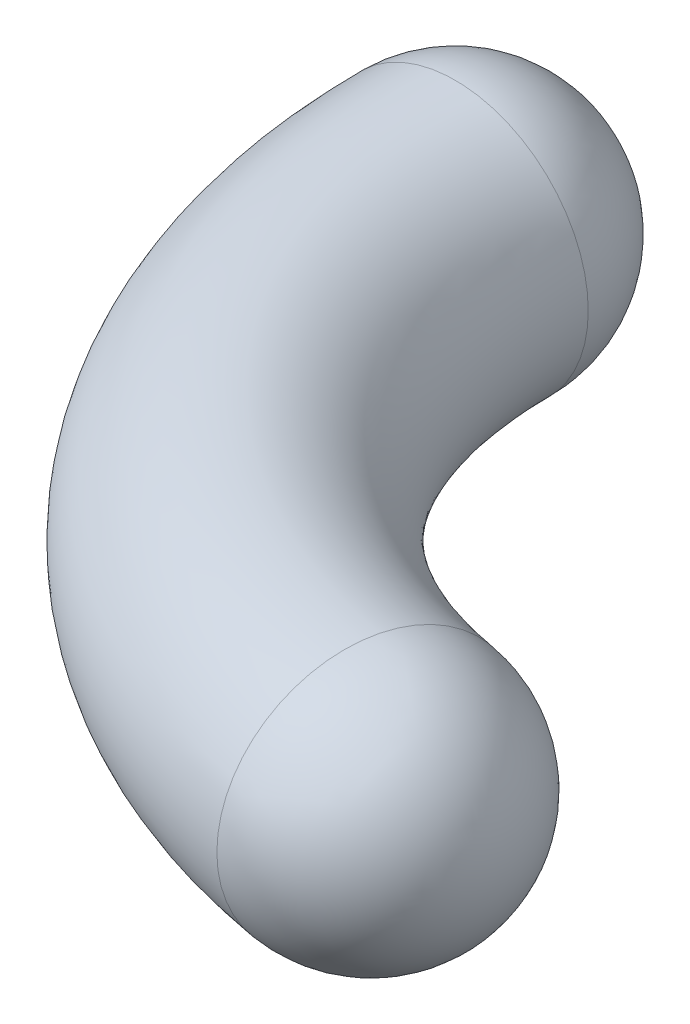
ISO-10303-21;
HEADER;
FILE_DESCRIPTION(('STEP AP214'),'2;1');
FILE_NAME('part.step','',(''),(''),'','','');
FILE_SCHEMA(('AUTOMOTIVE_DESIGN { 1 0 10303 214 1 1 1 1 }'));
ENDSEC;
DATA;
#1=APPLICATION_CONTEXT('core data for automotive mechanical design processes');
#2=APPLICATION_PROTOCOL_DEFINITION('international standard','automotive_design',2000,#1);
#3=PRODUCT_CONTEXT('',#1,'mechanical');
#4=PRODUCT('Part','Part','',(#3));
#5=PRODUCT_RELATED_PRODUCT_CATEGORY('part','',(#4));
#6=PRODUCT_DEFINITION_FORMATION('','',#4);
#7=PRODUCT_DEFINITION_CONTEXT('part definition',#1,'design');
#8=PRODUCT_DEFINITION('design','',#6,#7);
#9=PRODUCT_DEFINITION_SHAPE('','',#8);
#10=(LENGTH_UNIT() NAMED_UNIT(*) SI_UNIT(.MILLI.,.METRE.));
#11=(NAMED_UNIT(*) PLANE_ANGLE_UNIT() SI_UNIT($,.RADIAN.));
#12=(NAMED_UNIT(*) SI_UNIT($,.STERADIAN.) SOLID_ANGLE_UNIT());
#13=UNCERTAINTY_MEASURE_WITH_UNIT(LENGTH_MEASURE(1.E-05),#10,'distance_accuracy_value','');
#14=(GEOMETRIC_REPRESENTATION_CONTEXT(3) GLOBAL_UNCERTAINTY_ASSIGNED_CONTEXT((#13)) GLOBAL_UNIT_ASSIGNED_CONTEXT((#10,
#11,#12)) REPRESENTATION_CONTEXT('',''));
#15=CARTESIAN_POINT('',(0.,0.,0.));
#16=DIRECTION('',(0.,0.,1.));
#17=DIRECTION('',(1.,0.,0.));
#18=AXIS2_PLACEMENT_3D('',#15,#16,#17);
#19=CARTESIAN_POINT('',(0.,0.,0.));
#20=DIRECTION('',(0.,-1.,0.));
#21=DIRECTION('',(0.,0.,-1.));
#22=AXIS2_PLACEMENT_3D('',#19,#20,#21);
#23=TOROIDAL_SURFACE('',#22,40.,10.);
#24=CARTESIAN_POINT('',(-6.94592710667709,0.,39.3923101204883));
#25=DIRECTION('',(0.984807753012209,0.,0.173648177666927));
#26=DIRECTION('',(0.173648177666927,0.,-0.984807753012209));
#27=AXIS2_PLACEMENT_3D('',#24,#25,#26);
#28=CIRCLE('',#27,10.);
#29=CARTESIAN_POINT('',(-8.68240888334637,0.,49.2403876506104));
#30=VERTEX_POINT('',#29);
#31=EDGE_CURVE('E10',#30,#30,#28,.T.);
#32=CARTESIAN_POINT('',(-40.,0.,0.));
#33=DIRECTION('',(0.,0.,1.));
#34=DIRECTION('',(1.,0.,0.));
#35=AXIS2_PLACEMENT_3D('',#32,#33,#34);
#36=CIRCLE('',#35,10.);
#37=CARTESIAN_POINT('',(-50.,0.,0.));
#38=VERTEX_POINT('',#37);
#39=EDGE_CURVE('E43',#38,#38,#36,.T.);
#40=CARTESIAN_POINT('',(0.,0.,0.));
#41=DIRECTION('',(0.,-1.,0.));
#42=DIRECTION('',(0.,0.,-1.));
#43=AXIS2_PLACEMENT_3D('',#40,#41,#42);
#44=CIRCLE('',#43,50.);
#45=EDGE_CURVE('',#30,#38,#44,.T.);
#46=ORIENTED_EDGE('',*,*,#31,.F.);
#47=ORIENTED_EDGE('',*,*,#39,.T.);
#48=ORIENTED_EDGE('',*,*,#45,.T.);
#49=ORIENTED_EDGE('',*,*,#45,.F.);
#50=EDGE_LOOP('',(#46,#48,#47,#49));
#51=FACE_BOUND('',#50,.T.);
#52=ADVANCED_FACE('F36',(#51),#23,.T.);
#53=CARTESIAN_POINT('',(-6.94592710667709,0.,39.3923101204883));
#54=DIRECTION('',(0.,0.,1.));
#55=DIRECTION('',(1.,0.,0.));
#56=AXIS2_PLACEMENT_3D('',#53,#54,#55);
#57=SPHERICAL_SURFACE('',#56,10.);
#58=CARTESIAN_POINT('',(-6.94592710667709,0.,39.3923101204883));
#59=DIRECTION('',(0.984807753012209,0.,0.173648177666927));
#60=DIRECTION('',(0.173648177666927,0.,-0.984807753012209));
#61=AXIS2_PLACEMENT_3D('',#58,#59,#60);
#62=SPHERICAL_SURFACE('',#61,10.);
#63=ORIENTED_EDGE('',*,*,#31,.T.);
#64=EDGE_LOOP('',(#63));
#65=FACE_BOUND('',#64,.T.);
#66=ADVANCED_FACE('F38',(#65),#62,.T.);
#67=CARTESIAN_POINT('',(-40.,0.,0.));
#68=DIRECTION('',(0.,0.,1.));
#69=DIRECTION('',(1.,0.,0.));
#70=AXIS2_PLACEMENT_3D('',#67,#68,#69);
#71=SPHERICAL_SURFACE('',#70,10.);
#72=ORIENTED_EDGE('',*,*,#39,.F.);
#73=EDGE_LOOP('',(#72));
#74=FACE_BOUND('',#73,.T.);
#75=ADVANCED_FACE('F50',(#74),#71,.T.);
#76=CLOSED_SHELL('',(#52,#66,#75));
#77=MANIFOLD_SOLID_BREP('B2',#76);
#78=ADVANCED_BREP_SHAPE_REPRESENTATION('',(#18,#77),#14);
#79=SHAPE_DEFINITION_REPRESENTATION(#9,#78);
ENDSEC;
END-ISO-10303-21;
